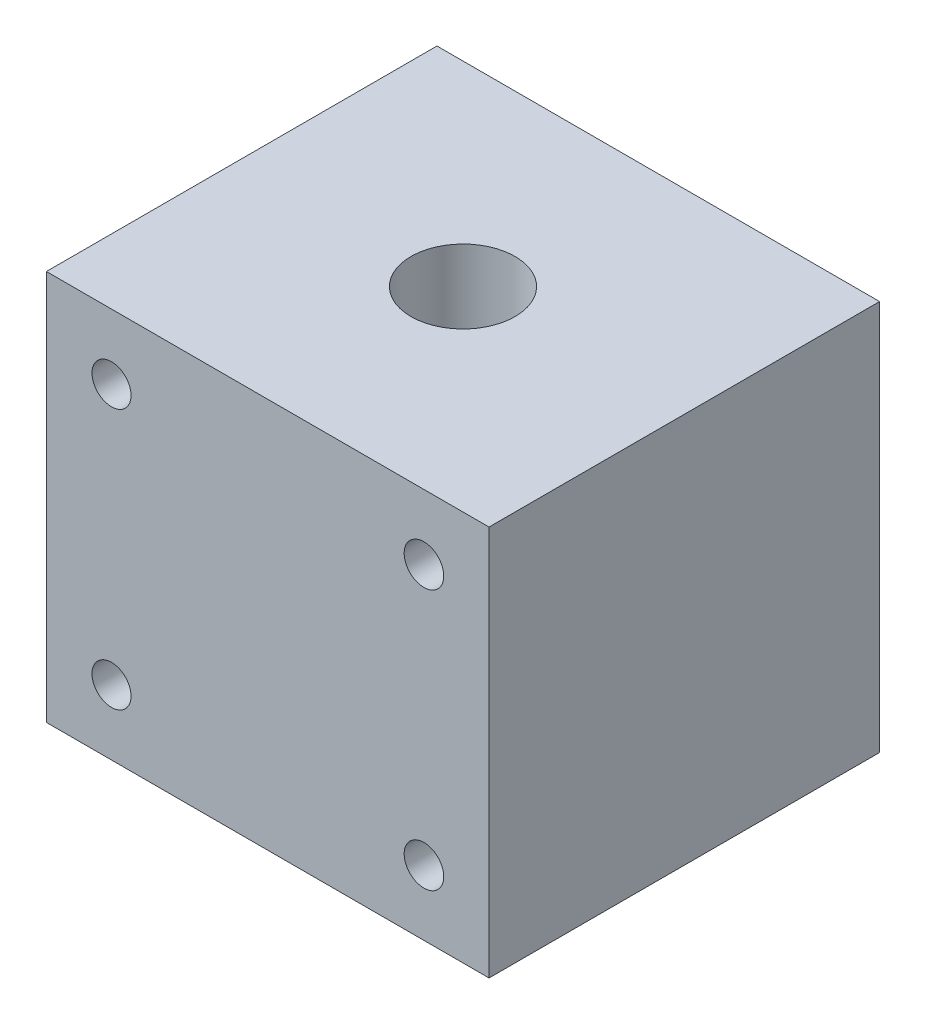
ISO-10303-21;
HEADER;
FILE_DESCRIPTION(('STEP AP214'),'2;1');
FILE_NAME('part.step','',(''),(''),'','','');
FILE_SCHEMA(('AUTOMOTIVE_DESIGN { 1 0 10303 214 1 1 1 1 }'));
ENDSEC;
DATA;
#1=APPLICATION_CONTEXT('core data for automotive mechanical design processes');
#2=APPLICATION_PROTOCOL_DEFINITION('international standard','automotive_design',2000,#1);
#3=PRODUCT_CONTEXT('',#1,'mechanical');
#4=PRODUCT('Part','Part','',(#3));
#5=PRODUCT_RELATED_PRODUCT_CATEGORY('part','',(#4));
#6=PRODUCT_DEFINITION_FORMATION('','',#4);
#7=PRODUCT_DEFINITION_CONTEXT('part definition',#1,'design');
#8=PRODUCT_DEFINITION('design','',#6,#7);
#9=PRODUCT_DEFINITION_SHAPE('','',#8);
#10=(LENGTH_UNIT() NAMED_UNIT(*) SI_UNIT(.MILLI.,.METRE.));
#11=(NAMED_UNIT(*) PLANE_ANGLE_UNIT() SI_UNIT($,.RADIAN.));
#12=(NAMED_UNIT(*) SI_UNIT($,.STERADIAN.) SOLID_ANGLE_UNIT());
#13=UNCERTAINTY_MEASURE_WITH_UNIT(LENGTH_MEASURE(1.E-05),#10,'distance_accuracy_value','');
#14=(GEOMETRIC_REPRESENTATION_CONTEXT(3) GLOBAL_UNCERTAINTY_ASSIGNED_CONTEXT((#13)) GLOBAL_UNIT_ASSIGNED_CONTEXT((#10,
#11,#12)) REPRESENTATION_CONTEXT('',''));
#15=CARTESIAN_POINT('',(0.,0.,0.));
#16=DIRECTION('',(0.,0.,1.));
#17=DIRECTION('',(1.,0.,0.));
#18=AXIS2_PLACEMENT_3D('',#15,#16,#17);
#19=CARTESIAN_POINT('',(0.,30.,0.));
#20=DIRECTION('',(0.,-1.,0.));
#21=DIRECTION('',(0.,0.,-1.));
#22=AXIS2_PLACEMENT_3D('',#19,#20,#21);
#23=PLANE('',#22);
#24=DIRECTION('',(0.,0.,1.));
#25=VECTOR('',#24,1.);
#26=CARTESIAN_POINT('',(0.,30.,0.));
#27=LINE('',#26,#25);
#28=CARTESIAN_POINT('',(0.,30.,-30.));
#29=VERTEX_POINT('',#28);
#30=CARTESIAN_POINT('',(0.,30.,0.));
#31=VERTEX_POINT('',#30);
#32=EDGE_CURVE('E89',#29,#31,#27,.T.);
#33=ORIENTED_EDGE('',*,*,#32,.T.);
#34=DIRECTION('',(1.,0.,0.));
#35=VECTOR('',#34,1.);
#36=CARTESIAN_POINT('',(0.,30.,0.));
#37=LINE('',#36,#35);
#38=CARTESIAN_POINT('',(34.,30.,0.));
#39=VERTEX_POINT('',#38);
#40=EDGE_CURVE('E84',#31,#39,#37,.T.);
#41=ORIENTED_EDGE('',*,*,#40,.T.);
#42=DIRECTION('',(0.,0.,-1.));
#43=VECTOR('',#42,1.);
#44=CARTESIAN_POINT('',(34.,30.,0.));
#45=LINE('',#44,#43);
#46=CARTESIAN_POINT('',(34.,30.,-30.));
#47=VERTEX_POINT('',#46);
#48=EDGE_CURVE('E87',#39,#47,#45,.T.);
#49=ORIENTED_EDGE('',*,*,#48,.T.);
#50=DIRECTION('',(-1.,0.,0.));
#51=VECTOR('',#50,1.);
#52=CARTESIAN_POINT('',(0.,30.,-30.));
#53=LINE('',#52,#51);
#54=EDGE_CURVE('E54',#47,#29,#53,.T.);
#55=ORIENTED_EDGE('',*,*,#54,.T.);
#56=EDGE_LOOP('',(#33,#41,#49,#55));
#57=FACE_BOUND('',#56,.T.);
#58=CARTESIAN_POINT('',(17.,30.,-15.));
#59=DIRECTION('',(0.,1.,0.));
#60=DIRECTION('',(0.,0.,1.));
#61=AXIS2_PLACEMENT_3D('',#58,#59,#60);
#62=CIRCLE('',#61,4.);
#63=CARTESIAN_POINT('',(17.,30.,-11.));
#64=VERTEX_POINT('',#63);
#65=EDGE_CURVE('E104',#64,#64,#62,.T.);
#66=ORIENTED_EDGE('',*,*,#65,.F.);
#67=EDGE_LOOP('',(#66));
#68=FACE_BOUND('',#67,.T.);
#69=ADVANCED_FACE('F37',(#57,#68),#23,.F.);
#70=CARTESIAN_POINT('',(0.,0.,0.));
#71=DIRECTION('',(0.,-1.,0.));
#72=DIRECTION('',(0.,0.,-1.));
#73=AXIS2_PLACEMENT_3D('',#70,#71,#72);
#74=PLANE('',#73);
#75=DIRECTION('',(0.,0.,1.));
#76=VECTOR('',#75,1.);
#77=CARTESIAN_POINT('',(0.,0.,0.));
#78=LINE('',#77,#76);
#79=CARTESIAN_POINT('',(0.,0.,-30.));
#80=VERTEX_POINT('',#79);
#81=CARTESIAN_POINT('',(0.,0.,0.));
#82=VERTEX_POINT('',#81);
#83=EDGE_CURVE('E101',#80,#82,#78,.T.);
#84=ORIENTED_EDGE('',*,*,#83,.F.);
#85=DIRECTION('',(-1.,0.,0.));
#86=VECTOR('',#85,1.);
#87=CARTESIAN_POINT('',(0.,0.,-30.));
#88=LINE('',#87,#86);
#89=CARTESIAN_POINT('',(34.,0.,-30.));
#90=VERTEX_POINT('',#89);
#91=EDGE_CURVE('E77',#90,#80,#88,.T.);
#92=ORIENTED_EDGE('',*,*,#91,.F.);
#93=DIRECTION('',(0.,0.,-1.));
#94=VECTOR('',#93,1.);
#95=CARTESIAN_POINT('',(34.,0.,0.));
#96=LINE('',#95,#94);
#97=CARTESIAN_POINT('',(34.,0.,0.));
#98=VERTEX_POINT('',#97);
#99=EDGE_CURVE('E71',#98,#90,#96,.T.);
#100=ORIENTED_EDGE('',*,*,#99,.F.);
#101=DIRECTION('',(1.,0.,0.));
#102=VECTOR('',#101,1.);
#103=CARTESIAN_POINT('',(0.,0.,0.));
#104=LINE('',#103,#102);
#105=EDGE_CURVE('E93',#82,#98,#104,.T.);
#106=ORIENTED_EDGE('',*,*,#105,.F.);
#107=EDGE_LOOP('',(#84,#92,#100,#106));
#108=FACE_BOUND('',#107,.T.);
#109=CARTESIAN_POINT('',(17.,0.,-15.));
#110=DIRECTION('',(0.,1.,0.));
#111=DIRECTION('',(0.,0.,1.));
#112=AXIS2_PLACEMENT_3D('',#109,#110,#111);
#113=CIRCLE('',#112,4.);
#114=CARTESIAN_POINT('',(17.,0.,-11.));
#115=VERTEX_POINT('',#114);
#116=EDGE_CURVE('E116',#115,#115,#113,.T.);
#117=ORIENTED_EDGE('',*,*,#116,.T.);
#118=EDGE_LOOP('',(#117));
#119=FACE_BOUND('',#118,.T.);
#120=ADVANCED_FACE('F112',(#108,#119),#74,.T.);
#121=CARTESIAN_POINT('',(0.,30.,0.));
#122=DIRECTION('',(1.,0.,0.));
#123=DIRECTION('',(0.,0.,-1.));
#124=AXIS2_PLACEMENT_3D('',#121,#122,#123);
#125=PLANE('',#124);
#126=ORIENTED_EDGE('',*,*,#83,.T.);
#127=DIRECTION('',(0.,-1.,0.));
#128=VECTOR('',#127,1.);
#129=CARTESIAN_POINT('',(0.,30.,0.));
#130=LINE('',#129,#128);
#131=EDGE_CURVE('E11',#31,#82,#130,.T.);
#132=ORIENTED_EDGE('',*,*,#131,.F.);
#133=ORIENTED_EDGE('',*,*,#32,.F.);
#134=DIRECTION('',(0.,-1.,0.));
#135=VECTOR('',#134,1.);
#136=CARTESIAN_POINT('',(0.,30.,-30.));
#137=LINE('',#136,#135);
#138=EDGE_CURVE('E97',#29,#80,#137,.T.);
#139=ORIENTED_EDGE('',*,*,#138,.T.);
#140=EDGE_LOOP('',(#126,#132,#133,#139));
#141=FACE_BOUND('',#140,.T.);
#142=ADVANCED_FACE('F39',(#141),#125,.F.);
#143=CARTESIAN_POINT('',(0.,30.,0.));
#144=DIRECTION('',(0.,0.,-1.));
#145=DIRECTION('',(-1.,0.,0.));
#146=AXIS2_PLACEMENT_3D('',#143,#144,#145);
#147=PLANE('',#146);
#148=CARTESIAN_POINT('',(29.,25.,0.));
#149=DIRECTION('',(0.,0.,1.));
#150=DIRECTION('',(1.,0.,0.));
#151=AXIS2_PLACEMENT_3D('',#148,#149,#150);
#152=CIRCLE('',#151,1.51988418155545);
#153=CARTESIAN_POINT('',(30.5198841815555,25.,0.));
#154=VERTEX_POINT('',#153);
#155=EDGE_CURVE('E140',#154,#154,#152,.T.);
#156=ORIENTED_EDGE('',*,*,#155,.F.);
#157=EDGE_LOOP('',(#156));
#158=FACE_BOUND('',#157,.T.);
#159=CARTESIAN_POINT('',(29.,5.,0.));
#160=DIRECTION('',(0.,0.,1.));
#161=DIRECTION('',(-1.,0.,0.));
#162=AXIS2_PLACEMENT_3D('',#159,#160,#161);
#163=CIRCLE('',#162,1.51988418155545);
#164=CARTESIAN_POINT('',(27.4801158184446,5.,0.));
#165=VERTEX_POINT('',#164);
#166=EDGE_CURVE('E134',#165,#165,#163,.T.);
#167=ORIENTED_EDGE('',*,*,#166,.F.);
#168=EDGE_LOOP('',(#167));
#169=FACE_BOUND('',#168,.T.);
#170=CARTESIAN_POINT('',(5.,5.,0.));
#171=DIRECTION('',(0.,0.,1.));
#172=DIRECTION('',(-1.,0.,0.));
#173=AXIS2_PLACEMENT_3D('',#170,#171,#172);
#174=CIRCLE('',#173,1.5);
#175=CARTESIAN_POINT('',(3.5,5.,0.));
#176=VERTEX_POINT('',#175);
#177=EDGE_CURVE('E128',#176,#176,#174,.T.);
#178=ORIENTED_EDGE('',*,*,#177,.F.);
#179=EDGE_LOOP('',(#178));
#180=FACE_BOUND('',#179,.T.);
#181=CARTESIAN_POINT('',(5.,25.,0.));
#182=DIRECTION('',(0.,0.,1.));
#183=DIRECTION('',(1.,0.,0.));
#184=AXIS2_PLACEMENT_3D('',#181,#182,#183);
#185=CIRCLE('',#184,1.5);
#186=CARTESIAN_POINT('',(6.5,25.,0.));
#187=VERTEX_POINT('',#186);
#188=EDGE_CURVE('E122',#187,#187,#185,.T.);
#189=ORIENTED_EDGE('',*,*,#188,.F.);
#190=EDGE_LOOP('',(#189));
#191=FACE_BOUND('',#190,.T.);
#192=ORIENTED_EDGE('',*,*,#105,.T.);
#193=DIRECTION('',(0.,-1.,0.));
#194=VECTOR('',#193,1.);
#195=CARTESIAN_POINT('',(34.,30.,0.));
#196=LINE('',#195,#194);
#197=EDGE_CURVE('E46',#39,#98,#196,.T.);
#198=ORIENTED_EDGE('',*,*,#197,.F.);
#199=ORIENTED_EDGE('',*,*,#40,.F.);
#200=ORIENTED_EDGE('',*,*,#131,.T.);
#201=EDGE_LOOP('',(#192,#198,#199,#200));
#202=FACE_BOUND('',#201,.T.);
#203=ADVANCED_FACE('F92',(#158,#169,#180,#191,#202),#147,.F.);
#204=CARTESIAN_POINT('',(34.,30.,0.));
#205=DIRECTION('',(-1.,0.,0.));
#206=DIRECTION('',(0.,0.,1.));
#207=AXIS2_PLACEMENT_3D('',#204,#205,#206);
#208=PLANE('',#207);
#209=ORIENTED_EDGE('',*,*,#99,.T.);
#210=DIRECTION('',(0.,-1.,0.));
#211=VECTOR('',#210,1.);
#212=CARTESIAN_POINT('',(34.,30.,-30.));
#213=LINE('',#212,#211);
#214=EDGE_CURVE('E94',#47,#90,#213,.T.);
#215=ORIENTED_EDGE('',*,*,#214,.F.);
#216=ORIENTED_EDGE('',*,*,#48,.F.);
#217=ORIENTED_EDGE('',*,*,#197,.T.);
#218=EDGE_LOOP('',(#209,#215,#216,#217));
#219=FACE_BOUND('',#218,.T.);
#220=ADVANCED_FACE('F95',(#219),#208,.F.);
#221=CARTESIAN_POINT('',(0.,30.,-30.));
#222=DIRECTION('',(0.,0.,1.));
#223=DIRECTION('',(1.,0.,0.));
#224=AXIS2_PLACEMENT_3D('',#221,#222,#223);
#225=PLANE('',#224);
#226=ORIENTED_EDGE('',*,*,#91,.T.);
#227=ORIENTED_EDGE('',*,*,#138,.F.);
#228=ORIENTED_EDGE('',*,*,#54,.F.);
#229=ORIENTED_EDGE('',*,*,#214,.T.);
#230=EDGE_LOOP('',(#226,#227,#228,#229));
#231=FACE_BOUND('',#230,.T.);
#232=ADVANCED_FACE('F109',(#231),#225,.F.);
#233=CARTESIAN_POINT('',(17.,30.,-15.));
#234=DIRECTION('',(0.,-1.,0.));
#235=DIRECTION('',(0.,0.,-1.));
#236=AXIS2_PLACEMENT_3D('',#233,#234,#235);
#237=CYLINDRICAL_SURFACE('',#236,4.);
#238=ORIENTED_EDGE('',*,*,#65,.T.);
#239=EDGE_LOOP('',(#238));
#240=FACE_BOUND('',#239,.T.);
#241=ORIENTED_EDGE('',*,*,#116,.F.);
#242=EDGE_LOOP('',(#241));
#243=FACE_BOUND('',#242,.T.);
#244=ADVANCED_FACE('F166',(#240,#243),#237,.F.);
#245=CARTESIAN_POINT('',(5.,25.,-10.));
#246=DIRECTION('',(0.,0.,1.));
#247=DIRECTION('',(1.,0.,0.));
#248=AXIS2_PLACEMENT_3D('',#245,#246,#247);
#249=CYLINDRICAL_SURFACE('',#248,1.5);
#250=CARTESIAN_POINT('',(5.,25.,-10.));
#251=DIRECTION('',(0.,0.,1.));
#252=DIRECTION('',(1.,0.,0.));
#253=AXIS2_PLACEMENT_3D('',#250,#251,#252);
#254=CIRCLE('',#253,1.5);
#255=CARTESIAN_POINT('',(6.5,25.,-10.));
#256=VERTEX_POINT('',#255);
#257=EDGE_CURVE('E119',#256,#256,#254,.T.);
#258=ORIENTED_EDGE('',*,*,#257,.F.);
#259=EDGE_LOOP('',(#258));
#260=FACE_BOUND('',#259,.T.);
#261=ORIENTED_EDGE('',*,*,#188,.T.);
#262=EDGE_LOOP('',(#261));
#263=FACE_BOUND('',#262,.T.);
#264=ADVANCED_FACE('F163',(#260,#263),#249,.F.);
#265=CARTESIAN_POINT('',(5.,25.,-10.));
#266=DIRECTION('',(0.,0.,1.));
#267=DIRECTION('',(1.,0.,0.));
#268=AXIS2_PLACEMENT_3D('',#265,#266,#267);
#269=PLANE('',#268);
#270=ORIENTED_EDGE('',*,*,#257,.T.);
#271=EDGE_LOOP('',(#270));
#272=FACE_BOUND('',#271,.T.);
#273=ADVANCED_FACE('F165',(#272),#269,.T.);
#274=CARTESIAN_POINT('',(5.,5.,-10.));
#275=DIRECTION('',(0.,0.,1.));
#276=DIRECTION('',(1.,0.,0.));
#277=AXIS2_PLACEMENT_3D('',#274,#275,#276);
#278=CYLINDRICAL_SURFACE('',#277,1.5);
#279=CARTESIAN_POINT('',(5.,5.,-10.));
#280=DIRECTION('',(0.,0.,1.));
#281=DIRECTION('',(-1.,0.,0.));
#282=AXIS2_PLACEMENT_3D('',#279,#280,#281);
#283=CIRCLE('',#282,1.5);
#284=CARTESIAN_POINT('',(3.5,5.,-10.));
#285=VERTEX_POINT('',#284);
#286=EDGE_CURVE('E131',#285,#285,#283,.T.);
#287=ORIENTED_EDGE('',*,*,#286,.F.);
#288=EDGE_LOOP('',(#287));
#289=FACE_BOUND('',#288,.T.);
#290=ORIENTED_EDGE('',*,*,#177,.T.);
#291=EDGE_LOOP('',(#290));
#292=FACE_BOUND('',#291,.T.);
#293=ADVANCED_FACE('F172',(#289,#292),#278,.F.);
#294=CARTESIAN_POINT('',(5.,5.,-10.));
#295=DIRECTION('',(0.,0.,-1.));
#296=DIRECTION('',(-1.,0.,0.));
#297=AXIS2_PLACEMENT_3D('',#294,#295,#296);
#298=PLANE('',#297);
#299=ORIENTED_EDGE('',*,*,#286,.T.);
#300=EDGE_LOOP('',(#299));
#301=FACE_BOUND('',#300,.T.);
#302=ADVANCED_FACE('F227',(#301),#298,.F.);
#303=CARTESIAN_POINT('',(29.,5.,-10.));
#304=DIRECTION('',(0.,0.,1.));
#305=DIRECTION('',(1.,0.,0.));
#306=AXIS2_PLACEMENT_3D('',#303,#304,#305);
#307=CYLINDRICAL_SURFACE('',#306,1.51988418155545);
#308=CARTESIAN_POINT('',(29.,5.,-10.));
#309=DIRECTION('',(0.,0.,1.));
#310=DIRECTION('',(-1.,0.,0.));
#311=AXIS2_PLACEMENT_3D('',#308,#309,#310);
#312=CIRCLE('',#311,1.51988418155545);
#313=CARTESIAN_POINT('',(27.4801158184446,5.,-10.));
#314=VERTEX_POINT('',#313);
#315=EDGE_CURVE('E137',#314,#314,#312,.T.);
#316=ORIENTED_EDGE('',*,*,#315,.F.);
#317=EDGE_LOOP('',(#316));
#318=FACE_BOUND('',#317,.T.);
#319=ORIENTED_EDGE('',*,*,#166,.T.);
#320=EDGE_LOOP('',(#319));
#321=FACE_BOUND('',#320,.T.);
#322=ADVANCED_FACE('F235',(#318,#321),#307,.F.);
#323=CARTESIAN_POINT('',(29.,5.,-10.));
#324=DIRECTION('',(0.,0.,-1.));
#325=DIRECTION('',(-1.,0.,0.));
#326=AXIS2_PLACEMENT_3D('',#323,#324,#325);
#327=PLANE('',#326);
#328=ORIENTED_EDGE('',*,*,#315,.T.);
#329=EDGE_LOOP('',(#328));
#330=FACE_BOUND('',#329,.T.);
#331=ADVANCED_FACE('F151',(#330),#327,.F.);
#332=CARTESIAN_POINT('',(29.,25.,-10.));
#333=DIRECTION('',(0.,0.,1.));
#334=DIRECTION('',(1.,0.,0.));
#335=AXIS2_PLACEMENT_3D('',#332,#333,#334);
#336=CYLINDRICAL_SURFACE('',#335,1.51988418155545);
#337=CARTESIAN_POINT('',(29.,25.,-10.));
#338=DIRECTION('',(0.,0.,1.));
#339=DIRECTION('',(1.,0.,0.));
#340=AXIS2_PLACEMENT_3D('',#337,#338,#339);
#341=CIRCLE('',#340,1.51988418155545);
#342=CARTESIAN_POINT('',(30.5198841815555,25.,-10.));
#343=VERTEX_POINT('',#342);
#344=EDGE_CURVE('E125',#343,#343,#341,.T.);
#345=ORIENTED_EDGE('',*,*,#344,.F.);
#346=EDGE_LOOP('',(#345));
#347=FACE_BOUND('',#346,.T.);
#348=ORIENTED_EDGE('',*,*,#155,.T.);
#349=EDGE_LOOP('',(#348));
#350=FACE_BOUND('',#349,.T.);
#351=ADVANCED_FACE('F148',(#347,#350),#336,.F.);
#352=CARTESIAN_POINT('',(29.,25.,-10.));
#353=DIRECTION('',(0.,0.,1.));
#354=DIRECTION('',(1.,0.,0.));
#355=AXIS2_PLACEMENT_3D('',#352,#353,#354);
#356=PLANE('',#355);
#357=ORIENTED_EDGE('',*,*,#344,.T.);
#358=EDGE_LOOP('',(#357));
#359=FACE_BOUND('',#358,.T.);
#360=ADVANCED_FACE('F146',(#359),#356,.T.);
#361=CLOSED_SHELL('',(#69,#120,#142,#203,#220,#232,#244,#264,#273,#293,#302,#322,#331,#351,#360));
#362=MANIFOLD_SOLID_BREP('B2',#361);
#363=ADVANCED_BREP_SHAPE_REPRESENTATION('',(#18,#362),#14);
#364=SHAPE_DEFINITION_REPRESENTATION(#9,#363);
ENDSEC;
END-ISO-10303-21;
